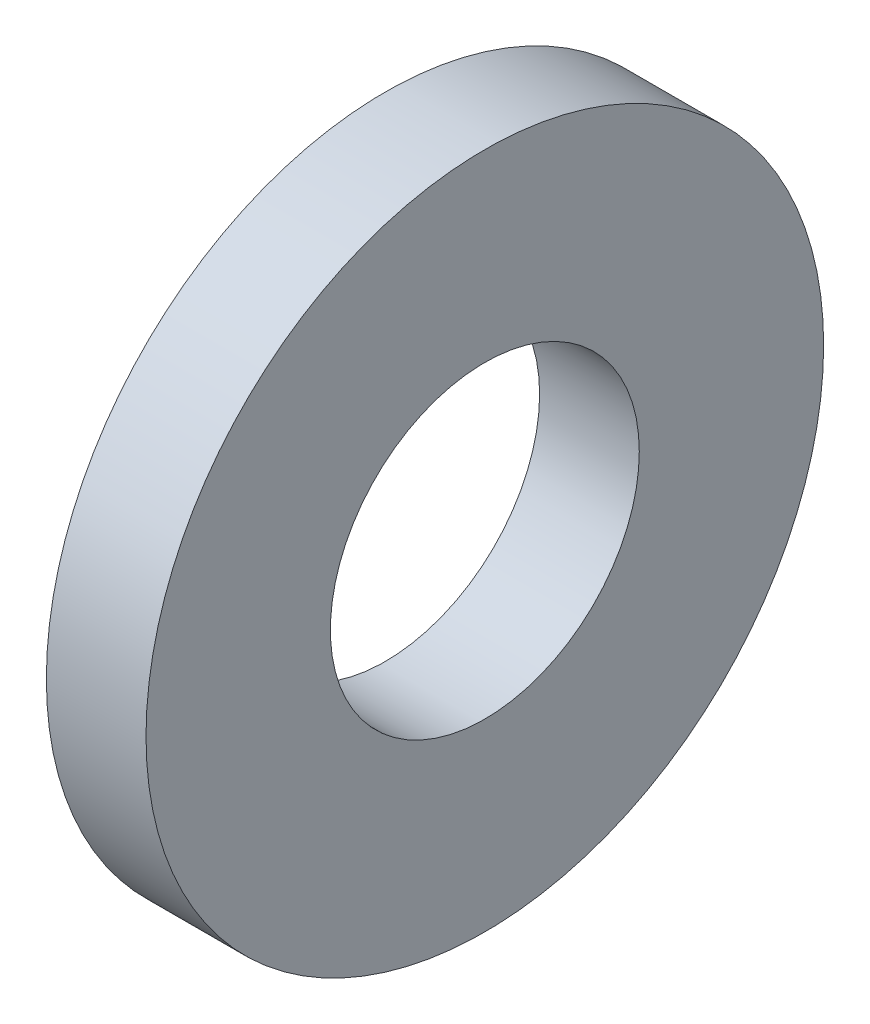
ISO-10303-21;
HEADER;
FILE_DESCRIPTION(('STEP AP214'),'2;1');
FILE_NAME('part.step','',(''),(''),'','','');
FILE_SCHEMA(('AUTOMOTIVE_DESIGN { 1 0 10303 214 1 1 1 1 }'));
ENDSEC;
DATA;
#1=APPLICATION_CONTEXT('core data for automotive mechanical design processes');
#2=APPLICATION_PROTOCOL_DEFINITION('international standard','automotive_design',2000,#1);
#3=PRODUCT_CONTEXT('',#1,'mechanical');
#4=PRODUCT('Part','Part','',(#3));
#5=PRODUCT_RELATED_PRODUCT_CATEGORY('part','',(#4));
#6=PRODUCT_DEFINITION_FORMATION('','',#4);
#7=PRODUCT_DEFINITION_CONTEXT('part definition',#1,'design');
#8=PRODUCT_DEFINITION('design','',#6,#7);
#9=PRODUCT_DEFINITION_SHAPE('','',#8);
#10=(LENGTH_UNIT() NAMED_UNIT(*) SI_UNIT(.MILLI.,.METRE.));
#11=(NAMED_UNIT(*) PLANE_ANGLE_UNIT() SI_UNIT($,.RADIAN.));
#12=(NAMED_UNIT(*) SI_UNIT($,.STERADIAN.) SOLID_ANGLE_UNIT());
#13=UNCERTAINTY_MEASURE_WITH_UNIT(LENGTH_MEASURE(1.E-05),#10,'distance_accuracy_value','');
#14=(GEOMETRIC_REPRESENTATION_CONTEXT(3) GLOBAL_UNCERTAINTY_ASSIGNED_CONTEXT((#13)) GLOBAL_UNIT_ASSIGNED_CONTEXT((#10,
#11,#12)) REPRESENTATION_CONTEXT('',''));
#15=CARTESIAN_POINT('',(0.,0.,0.));
#16=DIRECTION('',(0.,0.,1.));
#17=DIRECTION('',(1.,0.,0.));
#18=AXIS2_PLACEMENT_3D('',#15,#16,#17);
#19=CARTESIAN_POINT('',(10.,0.,0.));
#20=DIRECTION('',(1.,0.,0.));
#21=DIRECTION('',(0.,0.,-1.));
#22=AXIS2_PLACEMENT_3D('',#19,#20,#21);
#23=PLANE('',#22);
#24=CARTESIAN_POINT('',(10.,0.,0.));
#25=DIRECTION('',(1.,0.,0.));
#26=DIRECTION('',(0.,0.,-1.));
#27=AXIS2_PLACEMENT_3D('',#24,#25,#26);
#28=CIRCLE('',#27,34.);
#29=CARTESIAN_POINT('',(10.,0.,-34.));
#30=VERTEX_POINT('',#29);
#31=EDGE_CURVE('E10',#30,#30,#28,.T.);
#32=ORIENTED_EDGE('',*,*,#31,.T.);
#33=EDGE_LOOP('',(#32));
#34=FACE_BOUND('',#33,.T.);
#35=CARTESIAN_POINT('',(10.,0.,0.));
#36=DIRECTION('',(1.,0.,0.));
#37=DIRECTION('',(0.,0.,-1.));
#38=AXIS2_PLACEMENT_3D('',#35,#36,#37);
#39=CIRCLE('',#38,15.5);
#40=CARTESIAN_POINT('',(10.,0.,-15.5));
#41=VERTEX_POINT('',#40);
#42=EDGE_CURVE('E48',#41,#41,#39,.T.);
#43=ORIENTED_EDGE('',*,*,#42,.F.);
#44=EDGE_LOOP('',(#43));
#45=FACE_BOUND('',#44,.T.);
#46=ADVANCED_FACE('F37',(#34,#45),#23,.T.);
#47=CARTESIAN_POINT('',(0.,0.,0.));
#48=DIRECTION('',(1.,0.,0.));
#49=DIRECTION('',(0.,0.,-1.));
#50=AXIS2_PLACEMENT_3D('',#47,#48,#49);
#51=PLANE('',#50);
#52=CARTESIAN_POINT('',(0.,0.,0.));
#53=DIRECTION('',(1.,0.,0.));
#54=DIRECTION('',(0.,0.,-1.));
#55=AXIS2_PLACEMENT_3D('',#52,#53,#54);
#56=CIRCLE('',#55,34.);
#57=CARTESIAN_POINT('',(0.,0.,-34.));
#58=VERTEX_POINT('',#57);
#59=EDGE_CURVE('E41',#58,#58,#56,.T.);
#60=ORIENTED_EDGE('',*,*,#59,.F.);
#61=EDGE_LOOP('',(#60));
#62=FACE_BOUND('',#61,.T.);
#63=CARTESIAN_POINT('',(0.,0.,0.));
#64=DIRECTION('',(1.,0.,0.));
#65=DIRECTION('',(0.,0.,-1.));
#66=AXIS2_PLACEMENT_3D('',#63,#64,#65);
#67=CIRCLE('',#66,15.5);
#68=CARTESIAN_POINT('',(0.,0.,-15.5));
#69=VERTEX_POINT('',#68);
#70=EDGE_CURVE('E50',#69,#69,#67,.T.);
#71=ORIENTED_EDGE('',*,*,#70,.T.);
#72=EDGE_LOOP('',(#71));
#73=FACE_BOUND('',#72,.T.);
#74=ADVANCED_FACE('F60',(#62,#73),#51,.F.);
#75=CARTESIAN_POINT('',(10.,0.,0.));
#76=DIRECTION('',(-1.,0.,0.));
#77=DIRECTION('',(0.,0.,1.));
#78=AXIS2_PLACEMENT_3D('',#75,#76,#77);
#79=CYLINDRICAL_SURFACE('',#78,34.);
#80=ORIENTED_EDGE('',*,*,#31,.F.);
#81=EDGE_LOOP('',(#80));
#82=FACE_BOUND('',#81,.T.);
#83=ORIENTED_EDGE('',*,*,#59,.T.);
#84=EDGE_LOOP('',(#83));
#85=FACE_BOUND('',#84,.T.);
#86=ADVANCED_FACE('F39',(#82,#85),#79,.T.);
#87=CARTESIAN_POINT('',(10.,0.,0.));
#88=DIRECTION('',(-1.,0.,0.));
#89=DIRECTION('',(0.,0.,1.));
#90=AXIS2_PLACEMENT_3D('',#87,#88,#89);
#91=CYLINDRICAL_SURFACE('',#90,15.5);
#92=ORIENTED_EDGE('',*,*,#42,.T.);
#93=EDGE_LOOP('',(#92));
#94=FACE_BOUND('',#93,.T.);
#95=ORIENTED_EDGE('',*,*,#70,.F.);
#96=EDGE_LOOP('',(#95));
#97=FACE_BOUND('',#96,.T.);
#98=ADVANCED_FACE('F56',(#94,#97),#91,.F.);
#99=CLOSED_SHELL('',(#46,#74,#86,#98));
#100=MANIFOLD_SOLID_BREP('B2',#99);
#101=ADVANCED_BREP_SHAPE_REPRESENTATION('',(#18,#100),#14);
#102=SHAPE_DEFINITION_REPRESENTATION(#9,#101);
ENDSEC;
END-ISO-10303-21;
